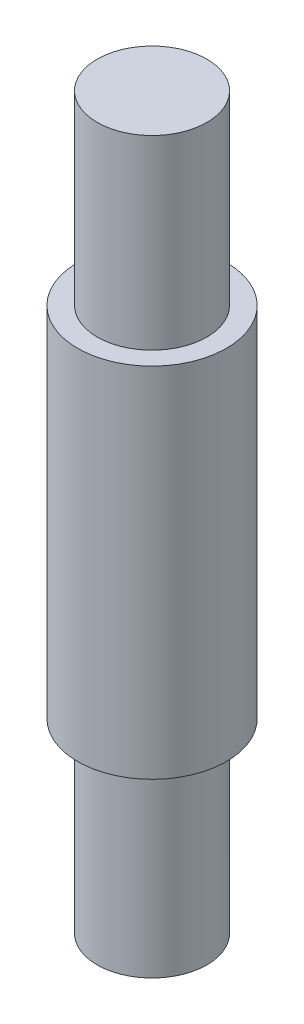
ISO-10303-21;
HEADER;
FILE_DESCRIPTION(('STEP AP214'),'2;1');
FILE_NAME('part.step','',(''),(''),'','','');
FILE_SCHEMA(('AUTOMOTIVE_DESIGN { 1 0 10303 214 1 1 1 1 }'));
ENDSEC;
DATA;
#1=APPLICATION_CONTEXT('core data for automotive mechanical design processes');
#2=APPLICATION_PROTOCOL_DEFINITION('international standard','automotive_design',2000,#1);
#3=PRODUCT_CONTEXT('',#1,'mechanical');
#4=PRODUCT('Part','Part','',(#3));
#5=PRODUCT_RELATED_PRODUCT_CATEGORY('part','',(#4));
#6=PRODUCT_DEFINITION_FORMATION('','',#4);
#7=PRODUCT_DEFINITION_CONTEXT('part definition',#1,'design');
#8=PRODUCT_DEFINITION('design','',#6,#7);
#9=PRODUCT_DEFINITION_SHAPE('','',#8);
#10=(LENGTH_UNIT() NAMED_UNIT(*) SI_UNIT(.MILLI.,.METRE.));
#11=(NAMED_UNIT(*) PLANE_ANGLE_UNIT() SI_UNIT($,.RADIAN.));
#12=(NAMED_UNIT(*) SI_UNIT($,.STERADIAN.) SOLID_ANGLE_UNIT());
#13=UNCERTAINTY_MEASURE_WITH_UNIT(LENGTH_MEASURE(1.E-05),#10,'distance_accuracy_value','');
#14=(GEOMETRIC_REPRESENTATION_CONTEXT(3) GLOBAL_UNCERTAINTY_ASSIGNED_CONTEXT((#13)) GLOBAL_UNIT_ASSIGNED_CONTEXT((#10,
#11,#12)) REPRESENTATION_CONTEXT('',''));
#15=CARTESIAN_POINT('',(0.,0.,0.));
#16=DIRECTION('',(0.,0.,1.));
#17=DIRECTION('',(1.,0.,0.));
#18=AXIS2_PLACEMENT_3D('',#15,#16,#17);
#19=CARTESIAN_POINT('',(0.,0.,0.));
#20=DIRECTION('',(0.,1.,0.));
#21=DIRECTION('',(0.,0.,1.));
#22=AXIS2_PLACEMENT_3D('',#19,#20,#21);
#23=PLANE('',#22);
#24=CARTESIAN_POINT('',(0.,0.,0.));
#25=DIRECTION('',(0.,1.,0.));
#26=DIRECTION('',(0.,0.,1.));
#27=AXIS2_PLACEMENT_3D('',#24,#25,#26);
#28=CIRCLE('',#27,0.799999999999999);
#29=CARTESIAN_POINT('',(0.,0.,-0.799999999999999));
#30=VERTEX_POINT('',#29);
#31=EDGE_CURVE('E46',#30,#30,#28,.T.);
#32=ORIENTED_EDGE('',*,*,#31,.F.);
#33=EDGE_LOOP('',(#32));
#34=FACE_BOUND('',#33,.T.);
#35=CARTESIAN_POINT('',(0.,0.,0.));
#36=DIRECTION('',(0.,1.,0.));
#37=DIRECTION('',(0.,0.,1.));
#38=AXIS2_PLACEMENT_3D('',#35,#36,#37);
#39=CIRCLE('',#38,0.59);
#40=CARTESIAN_POINT('',(0.,0.,0.59));
#41=VERTEX_POINT('',#40);
#42=EDGE_CURVE('E10',#41,#41,#39,.F.);
#43=ORIENTED_EDGE('',*,*,#42,.F.);
#44=EDGE_LOOP('',(#43));
#45=FACE_BOUND('',#44,.T.);
#46=ADVANCED_FACE('F35',(#34,#45),#23,.F.);
#47=CARTESIAN_POINT('',(0.,3.85,0.));
#48=DIRECTION('',(0.,1.,0.));
#49=DIRECTION('',(0.,0.,1.));
#50=AXIS2_PLACEMENT_3D('',#47,#48,#49);
#51=PLANE('',#50);
#52=CARTESIAN_POINT('',(0.,3.85,0.));
#53=DIRECTION('',(0.,1.,0.));
#54=DIRECTION('',(0.,0.,1.));
#55=AXIS2_PLACEMENT_3D('',#52,#53,#54);
#56=CIRCLE('',#55,0.799999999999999);
#57=CARTESIAN_POINT('',(0.,3.85,-0.799999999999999));
#58=VERTEX_POINT('',#57);
#59=EDGE_CURVE('E42',#58,#58,#56,.T.);
#60=ORIENTED_EDGE('',*,*,#59,.T.);
#61=EDGE_LOOP('',(#60));
#62=FACE_BOUND('',#61,.T.);
#63=CARTESIAN_POINT('',(0.,3.85,0.));
#64=DIRECTION('',(0.,1.,0.));
#65=DIRECTION('',(0.,0.,1.));
#66=AXIS2_PLACEMENT_3D('',#63,#64,#65);
#67=CIRCLE('',#66,0.59);
#68=CARTESIAN_POINT('',(0.,3.85,0.59));
#69=VERTEX_POINT('',#68);
#70=EDGE_CURVE('E53',#69,#69,#67,.T.);
#71=ORIENTED_EDGE('',*,*,#70,.F.);
#72=EDGE_LOOP('',(#71));
#73=FACE_BOUND('',#72,.T.);
#74=ADVANCED_FACE('F77',(#62,#73),#51,.T.);
#75=CARTESIAN_POINT('',(0.,3.85,0.));
#76=DIRECTION('',(0.,-1.,0.));
#77=DIRECTION('',(0.,0.,-1.));
#78=AXIS2_PLACEMENT_3D('',#75,#76,#77);
#79=CYLINDRICAL_SURFACE('',#78,0.799999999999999);
#80=CARTESIAN_POINT('',(0.,3.85,-0.799999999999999));
#81=CARTESIAN_POINT('',(0.,3.80989583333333,-0.799999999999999));
#82=CARTESIAN_POINT('',(0.,3.76979166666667,-0.799999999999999));
#83=CARTESIAN_POINT('',(0.,3.68958333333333,-0.799999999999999));
#84=CARTESIAN_POINT('',(0.,3.64947916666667,-0.799999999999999));
#85=CARTESIAN_POINT('',(0.,3.56927083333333,-0.799999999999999));
#86=CARTESIAN_POINT('',(0.,3.52916666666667,-0.799999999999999));
#87=CARTESIAN_POINT('',(0.,3.44895833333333,-0.799999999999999));
#88=CARTESIAN_POINT('',(0.,3.40885416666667,-0.799999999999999));
#89=CARTESIAN_POINT('',(0.,3.32864583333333,-0.799999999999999));
#90=CARTESIAN_POINT('',(0.,3.28854166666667,-0.799999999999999));
#91=CARTESIAN_POINT('',(0.,3.20833333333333,-0.799999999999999));
#92=CARTESIAN_POINT('',(0.,3.16822916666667,-0.799999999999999));
#93=CARTESIAN_POINT('',(0.,3.08802083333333,-0.799999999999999));
#94=CARTESIAN_POINT('',(0.,3.04791666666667,-0.799999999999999));
#95=CARTESIAN_POINT('',(0.,2.96770833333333,-0.799999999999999));
#96=CARTESIAN_POINT('',(0.,2.92760416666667,-0.799999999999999));
#97=CARTESIAN_POINT('',(0.,2.84739583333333,-0.799999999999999));
#98=CARTESIAN_POINT('',(0.,2.80729166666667,-0.799999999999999));
#99=CARTESIAN_POINT('',(0.,2.72708333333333,-0.799999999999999));
#100=CARTESIAN_POINT('',(0.,2.68697916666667,-0.799999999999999));
#101=CARTESIAN_POINT('',(0.,2.60677083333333,-0.799999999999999));
#102=CARTESIAN_POINT('',(0.,2.56666666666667,-0.799999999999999));
#103=CARTESIAN_POINT('',(0.,2.48645833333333,-0.799999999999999));
#104=CARTESIAN_POINT('',(0.,2.44635416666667,-0.799999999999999));
#105=CARTESIAN_POINT('',(0.,2.36614583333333,-0.799999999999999));
#106=CARTESIAN_POINT('',(0.,2.32604166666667,-0.799999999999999));
#107=CARTESIAN_POINT('',(0.,2.24583333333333,-0.799999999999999));
#108=CARTESIAN_POINT('',(0.,2.20572916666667,-0.799999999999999));
#109=CARTESIAN_POINT('',(0.,2.12552083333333,-0.799999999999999));
#110=CARTESIAN_POINT('',(0.,2.08541666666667,-0.799999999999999));
#111=CARTESIAN_POINT('',(0.,2.00520833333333,-0.799999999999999));
#112=CARTESIAN_POINT('',(0.,1.96510416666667,-0.799999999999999));
#113=CARTESIAN_POINT('',(0.,1.88489583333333,-0.799999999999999));
#114=CARTESIAN_POINT('',(0.,1.84479166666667,-0.799999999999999));
#115=CARTESIAN_POINT('',(0.,1.76458333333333,-0.799999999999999));
#116=CARTESIAN_POINT('',(0.,1.72447916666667,-0.799999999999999));
#117=CARTESIAN_POINT('',(0.,1.64427083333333,-0.799999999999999));
#118=CARTESIAN_POINT('',(0.,1.60416666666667,-0.799999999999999));
#119=CARTESIAN_POINT('',(0.,1.52395833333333,-0.799999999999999));
#120=CARTESIAN_POINT('',(0.,1.48385416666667,-0.799999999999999));
#121=CARTESIAN_POINT('',(0.,1.40364583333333,-0.799999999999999));
#122=CARTESIAN_POINT('',(0.,1.36354166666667,-0.799999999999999));
#123=CARTESIAN_POINT('',(0.,1.28333333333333,-0.799999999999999));
#124=CARTESIAN_POINT('',(0.,1.24322916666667,-0.799999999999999));
#125=CARTESIAN_POINT('',(0.,1.16302083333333,-0.799999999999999));
#126=CARTESIAN_POINT('',(0.,1.12291666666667,-0.799999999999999));
#127=CARTESIAN_POINT('',(0.,1.04270833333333,-0.799999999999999));
#128=CARTESIAN_POINT('',(0.,1.00260416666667,-0.799999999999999));
#129=CARTESIAN_POINT('',(0.,0.922395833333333,-0.799999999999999));
#130=CARTESIAN_POINT('',(0.,0.882291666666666,-0.799999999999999));
#131=CARTESIAN_POINT('',(0.,0.802083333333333,-0.799999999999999));
#132=CARTESIAN_POINT('',(0.,0.761979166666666,-0.799999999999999));
#133=CARTESIAN_POINT('',(0.,0.681770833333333,-0.799999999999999));
#134=CARTESIAN_POINT('',(0.,0.641666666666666,-0.799999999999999));
#135=CARTESIAN_POINT('',(0.,0.561458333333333,-0.799999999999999));
#136=CARTESIAN_POINT('',(0.,0.521354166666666,-0.799999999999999));
#137=CARTESIAN_POINT('',(0.,0.441145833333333,-0.799999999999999));
#138=CARTESIAN_POINT('',(0.,0.401041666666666,-0.799999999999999));
#139=CARTESIAN_POINT('',(0.,0.320833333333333,-0.799999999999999));
#140=CARTESIAN_POINT('',(0.,0.280729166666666,-0.799999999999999));
#141=CARTESIAN_POINT('',(0.,0.200520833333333,-0.799999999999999));
#142=CARTESIAN_POINT('',(0.,0.160416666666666,-0.799999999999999));
#143=CARTESIAN_POINT('',(0.,0.080208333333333,-0.799999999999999));
#144=CARTESIAN_POINT('',(0.,0.0401041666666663,-0.799999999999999));
#145=CARTESIAN_POINT('',(0.,0.,-0.799999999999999));
#146=B_SPLINE_CURVE_WITH_KNOTS('',3,(#80,#81,#82,#83,#84,#85,#86,#87,#88,#89,#90,#91,#92,#93,
#94,#95,#96,#97,#98,#99,#100,#101,#102,#103,#104,#105,#106,#107,#108,#109,#110,#111,#112,#113,
#114,#115,#116,#117,#118,#119,#120,#121,#122,#123,#124,#125,#126,#127,#128,#129,#130,#131,#132,
#133,#134,#135,#136,#137,#138,#139,#140,#141,#142,#143,#144,#145),.UNSPECIFIED.,.F.,.F.,(4,2,2,
2,2,2,2,2,2,2,2,2,2,2,2,2,2,2,2,2,2,2,2,2,2,2,2,2,2,2,2,2,4),(0.,0.1203125,0.240625,0.3609375,
0.48125,0.6015625,0.721875,0.842187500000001,0.9625,1.0828125,1.203125,1.3234375,1.44375,
1.5640625,1.684375,1.8046875,1.925,2.0453125,2.165625,2.2859375,2.40625,2.5265625,2.646875,
2.7671875,2.8875,3.0078125,3.128125,3.2484375,3.36875,3.4890625,3.609375,3.7296875,3.85),.UNSPECIFIED.);
#147=EDGE_CURVE('BSEAM37',#58,#30,#146,.T.);
#148=ORIENTED_EDGE('',*,*,#59,.F.);
#149=ORIENTED_EDGE('',*,*,#31,.T.);
#150=ORIENTED_EDGE('',*,*,#147,.T.);
#151=ORIENTED_EDGE('',*,*,#147,.F.);
#152=EDGE_LOOP('',(#148,#150,#149,#151));
#153=FACE_BOUND('',#152,.T.);
#154=ADVANCED_FACE('F37',(#153),#79,.T.);
#155=CARTESIAN_POINT('',(0.,5.85,0.));
#156=DIRECTION('',(0.,-1.,0.));
#157=DIRECTION('',(0.,0.,-1.));
#158=AXIS2_PLACEMENT_3D('',#155,#156,#157);
#159=CYLINDRICAL_SURFACE('',#158,0.59);
#160=CARTESIAN_POINT('',(0.,5.85,0.));
#161=DIRECTION('',(0.,1.,0.));
#162=DIRECTION('',(0.,0.,1.));
#163=AXIS2_PLACEMENT_3D('',#160,#161,#162);
#164=CIRCLE('',#163,0.59);
#165=CARTESIAN_POINT('',(0.,5.85,0.59));
#166=VERTEX_POINT('',#165);
#167=EDGE_CURVE('E51',#166,#166,#164,.T.);
#168=ORIENTED_EDGE('',*,*,#167,.F.);
#169=EDGE_LOOP('',(#168));
#170=FACE_BOUND('',#169,.T.);
#171=ORIENTED_EDGE('',*,*,#70,.T.);
#172=EDGE_LOOP('',(#171));
#173=FACE_BOUND('',#172,.T.);
#174=ADVANCED_FACE('F73',(#170,#173),#159,.T.);
#175=CARTESIAN_POINT('',(0.,5.85,0.));
#176=DIRECTION('',(0.,1.,0.));
#177=DIRECTION('',(0.,0.,1.));
#178=AXIS2_PLACEMENT_3D('',#175,#176,#177);
#179=PLANE('',#178);
#180=ORIENTED_EDGE('',*,*,#167,.T.);
#181=EDGE_LOOP('',(#180));
#182=FACE_BOUND('',#181,.T.);
#183=ADVANCED_FACE('F66',(#182),#179,.T.);
#184=CARTESIAN_POINT('',(0.,-2.,0.));
#185=DIRECTION('',(0.,1.,0.));
#186=DIRECTION('',(0.,0.,1.));
#187=AXIS2_PLACEMENT_3D('',#184,#185,#186);
#188=CYLINDRICAL_SURFACE('',#187,0.59);
#189=CARTESIAN_POINT('',(0.,-2.,0.));
#190=DIRECTION('',(0.,-1.,0.));
#191=DIRECTION('',(0.,0.,-1.));
#192=AXIS2_PLACEMENT_3D('',#189,#190,#191);
#193=CIRCLE('',#192,0.59);
#194=CARTESIAN_POINT('',(0.,-2.,-0.59));
#195=VERTEX_POINT('',#194);
#196=EDGE_CURVE('E56',#195,#195,#193,.T.);
#197=ORIENTED_EDGE('',*,*,#196,.F.);
#198=EDGE_LOOP('',(#197));
#199=FACE_BOUND('',#198,.T.);
#200=ORIENTED_EDGE('',*,*,#42,.T.);
#201=EDGE_LOOP('',(#200));
#202=FACE_BOUND('',#201,.T.);
#203=ADVANCED_FACE('F64',(#199,#202),#188,.T.);
#204=CARTESIAN_POINT('',(0.,-2.,0.));
#205=DIRECTION('',(0.,-1.,0.));
#206=DIRECTION('',(0.,0.,-1.));
#207=AXIS2_PLACEMENT_3D('',#204,#205,#206);
#208=PLANE('',#207);
#209=ORIENTED_EDGE('',*,*,#196,.T.);
#210=EDGE_LOOP('',(#209));
#211=FACE_BOUND('',#210,.T.);
#212=ADVANCED_FACE('F62',(#211),#208,.T.);
#213=CLOSED_SHELL('',(#46,#74,#154,#174,#183,#203,#212));
#214=MANIFOLD_SOLID_BREP('B2',#213);
#215=ADVANCED_BREP_SHAPE_REPRESENTATION('',(#18,#214),#14);
#216=SHAPE_DEFINITION_REPRESENTATION(#9,#215);
ENDSEC;
END-ISO-10303-21;
